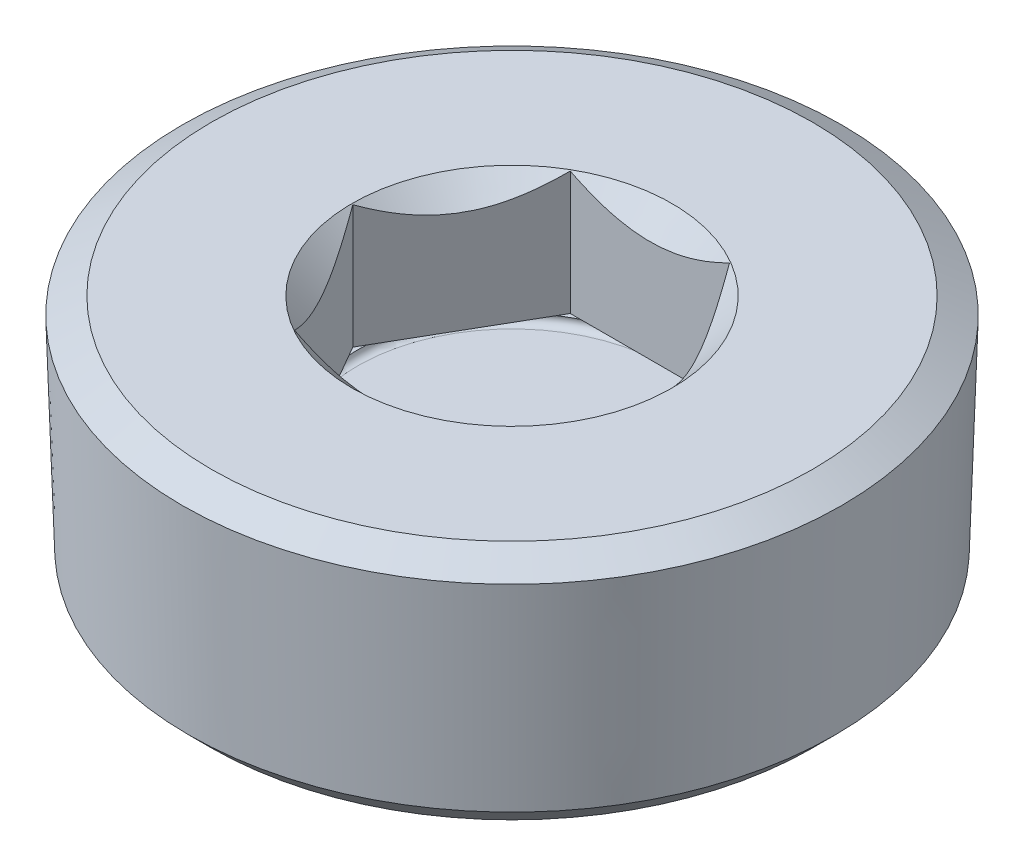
from build123d import *

# Parameters (mm, degrees)
CUT_EXTRUDE1_START = -11.43
CUT_EXTRUDE1_DEPTH = 11.362697


with BuildPart() as part:
    # Sketch2 → Revolve1 (revolve)
    with BuildSketch(Plane.XY, mode=Mode.PRIVATE) as revolve1_sk:
        Polygon((0, 0), (-27.690710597, 0), (-30.368243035, -1.545874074), (-29.788186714, -20.127523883), (-27.690710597, -22.225), (0, -22.225), align=None)
    revolve(revolve1_sk.sketch.rotate(Axis((0, 10.744282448, 0), (0, -1, 0)), 270), axis=Axis((0, 10.744282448, 0), (0, -1, 0)))

    # Sketch3 → Cut-Revolve1 (revolve, cut)
    with BuildSketch(Plane.XY, mode=Mode.PRIVATE) as cut_revolve1_sk:
        with BuildLine():
            Line((0, 0), (-14.732, 0))
            Line((-14.732, 0), (-12.7, -2.032))
            Line((-12.7, -2.032), (-12.7, -11.43))
            Line((-12.7, -11.43), (-14.224, -11.43))
            ThreePointArc((-14.224, -11.43), (-14.859, -12.065), (-14.224, -12.7))
            Line((-14.224, -12.7), (0, -12.7))
            Line((0, -12.7), (0, 0))
        make_face()
    revolve(cut_revolve1_sk.sketch.rotate(Axis((0, 2.934222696, 0), (0, -1, 0)), 270), axis=Axis((0, 2.934222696, 0), (0, -1, 0)), mode=Mode.SUBTRACT)

    # Sketch4 → Cut-Extrude1 (cut)
    with BuildSketch(Plane(origin=(0, 0, 0), x_dir=(1, 0, 0), z_dir=(0, 1, 0)).offset(CUT_EXTRUDE1_START)):
        Polygon((-7.332348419, -12.7), (7.332348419, -12.7), (14.664696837, 0), (7.332348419, 12.7), (-7.332348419, 12.7), (-14.664696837, 0), align=None)
    extrude(amount=CUT_EXTRUDE1_DEPTH, mode=Mode.SUBTRACT)


solid = part.part
